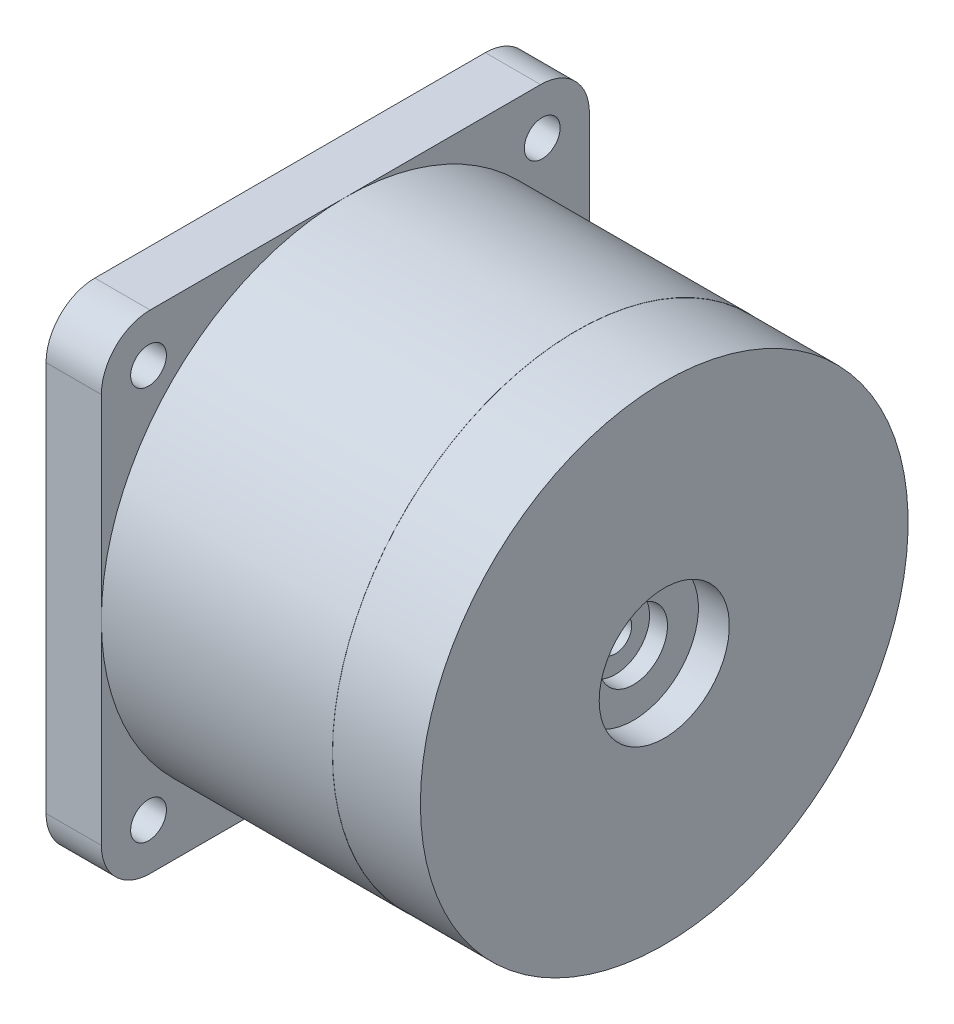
from build123d import *

# Parameters (mm, degrees)
ESQUISSE2_W             = 30
ESQUISSE2_H             = 30
ESQUISSE2_R             = 1.1
EXTRUSION1_DEPTH        = 3.4
ESQUISSE3_R             = 13.5
ENL_V_MAT_EXTRU_1_DEPTH = 1.6
CONG_1_R                = 3
ESQUISSE4_R             = 5
EXTRUSION2_DEPTH        = 7.55
ESQUISSE6_R             = 2.5
ENL_V_MAT_EXTRU_2_DEPTH = 15


with BuildPart() as part:
    # Esquisse1 → R_volution1 (revolve)
    with BuildSketch(Plane.XY, mode=Mode.PRIVATE) as r_volution1_sk:
        Polygon((0, 0), (0, 14.99), (-5.4, 14.99), (-5.4, 15), (-19.6, 15), (-19.6, 0), align=None)
    revolve(r_volution1_sk.sketch.rotate(Axis((0, 0, 0), (1, 0, 0)), 90), axis=Axis((0, 0, 0), (1, 0, 0)))

    # Esquisse2 → Extrusion1 (add)
    with BuildSketch(Plane.ZY.offset(19.6)):
        Rectangle(ESQUISSE2_W, ESQUISSE2_H)
        with Locations((-12.1, 12.1)):
            Circle(ESQUISSE2_R, mode=Mode.SUBTRACT)
        with Locations((12.1, 12.1)):
            Circle(ESQUISSE2_R, mode=Mode.SUBTRACT)
        with Locations((-12.1, -12.1)):
            Circle(ESQUISSE2_R, mode=Mode.SUBTRACT)
        with Locations((12.1, -12.1)):
            Circle(ESQUISSE2_R, mode=Mode.SUBTRACT)
    extrude(amount=EXTRUSION1_DEPTH)

    # Esquisse3 → Enl_v. mat.-Extru.1 (cut)
    with BuildSketch(Plane.ZY.offset(23)):
        Circle(ESQUISSE3_R)
    extrude(amount=-ENL_V_MAT_EXTRU_1_DEPTH, mode=Mode.SUBTRACT)

    # Cong_1
    cong_1_edges = [part.edges().sort_by_distance(p)[0] for p in [
        (-21.3, 15, -15),
        (-21.3, -15, -15),
        (-21.3, -15, 15),
        (-21.3, 15, 15),
    ]]
    fillet(cong_1_edges, radius=CONG_1_R)

    # Esquisse4 → Extrusion2 (add)
    with BuildSketch(Plane.ZY.offset(21.4)):
        with Locations(Location((0, -4.9, 0), (0, 0, 180))):
            Circle(ESQUISSE4_R)
    extrude(amount=EXTRUSION2_DEPTH)

    # Esquisse5 → Enl_vement de mati_re-R_volution1 (revolve, cut)
    with BuildSketch(Plane.XY, mode=Mode.PRIVATE) as enl_vement_de_mati_re_r_volution1_sk:
        Polygon((0, 0), (0, 4), (-1.9, 4), (-1.9, 2.1), (-3, 2.1), (-3, 1), (-11.5, 1), (-11.5, 0), align=None)
    revolve(enl_vement_de_mati_re_r_volution1_sk.sketch.rotate(Axis((0, 0, 0), (1, 0, 0)), 90), axis=Axis((0, 0, 0), (1, 0, 0)), mode=Mode.SUBTRACT)

    # Esquisse6 → Enl_v. mat.-Extru.2 (cut)
    with BuildSketch(Plane.ZY.offset(28.95)):
        with Locations((0, -4.9)):
            Circle(ESQUISSE6_R)
    extrude(amount=-ENL_V_MAT_EXTRU_2_DEPTH, mode=Mode.SUBTRACT)


solid = part.part
